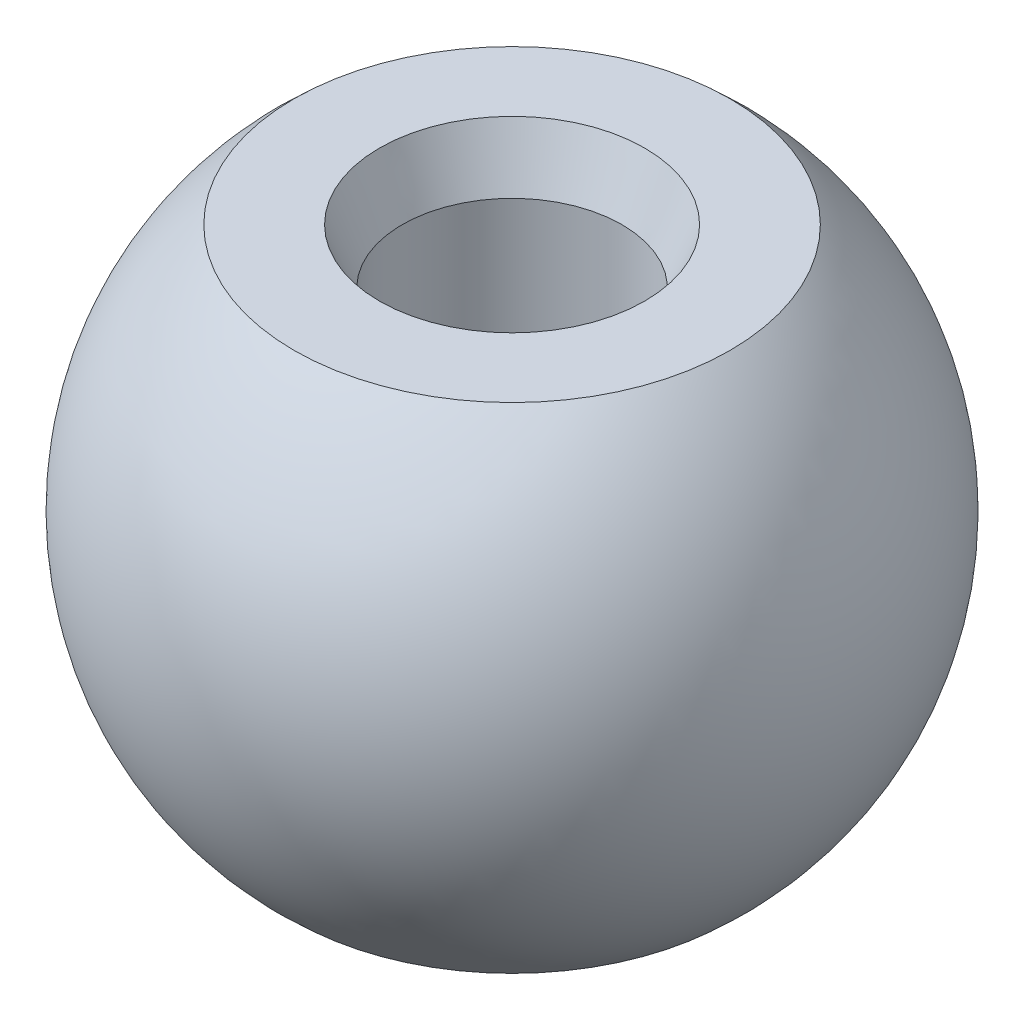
from build123d import *

# Parameters (mm, degrees)
SKETCH2_W      = 12
SKETCH2_H      = 12
EXTRUDE1_DEPTH = 20


with BuildPart() as part:
    # Sketch1 → Revolve1 (revolve)
    with BuildSketch(Plane(origin=(0, 0, 0), x_dir=(1, 0, 0), z_dir=(0, 1, 0))):
        with BuildLine():
            Line((0, 6), (0, -6))
            ThreePointArc((0, -6), (-6, 0), (0, 6))
        make_face()
    revolve(axis=Axis((0, 0, -6), (0, 0, 1)))

    # Sketch2 → Extrude1 (cut)
    with BuildSketch(Plane(origin=(0, 4.5, 0), x_dir=(-1, 0, 0), z_dir=(0, 1, 0))):
        Rectangle(SKETCH2_W, SKETCH2_H)
    extrude1 = extrude(amount=EXTRUDE1_DEPTH, mode=Mode.SUBTRACT)

    # Mirror1: Extrude1 across plane
    add(extrude1.mirror(Plane.ZX), mode=Mode.SUBTRACT)

    # Sketch3 → Cut-Revolve1 (revolve, cut)
    with BuildSketch(Plane.XY, mode=Mode.PRIVATE) as cut_revolve1_sk:
        Polygon((0, -4.5), (-2, -4.5), (-2, 3.5), (-2.414213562, 4.5), (0, 4.5), align=None)
    revolve(cut_revolve1_sk.sketch.rotate(Axis((0, -4.5, 0), (0, 1, 0)), 270), axis=Axis((0, -4.5, 0), (0, 1, 0)), mode=Mode.SUBTRACT)


solid = part.part
